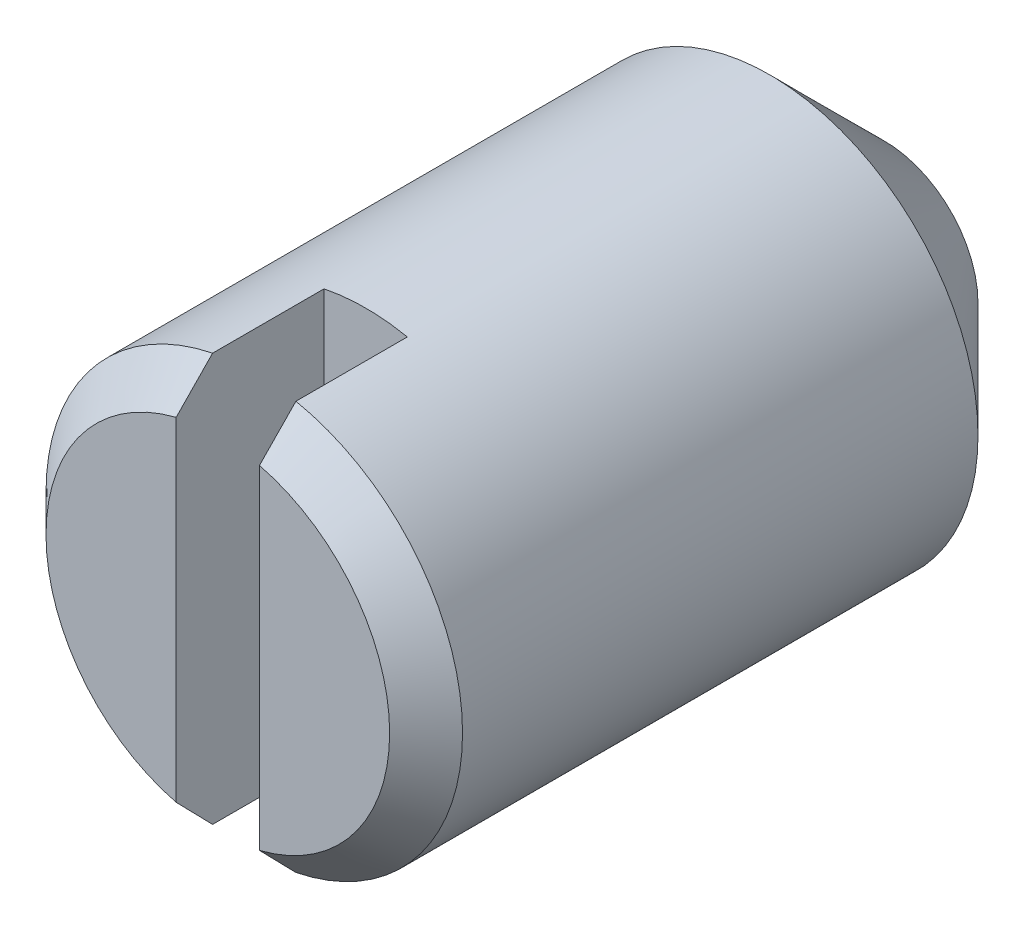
ISO-10303-21;
HEADER;
FILE_DESCRIPTION(('STEP AP214'),'2;1');
FILE_NAME('part.step','',(''),(''),'','','');
FILE_SCHEMA(('AUTOMOTIVE_DESIGN { 1 0 10303 214 1 1 1 1 }'));
ENDSEC;
DATA;
#1=APPLICATION_CONTEXT('core data for automotive mechanical design processes');
#2=APPLICATION_PROTOCOL_DEFINITION('international standard','automotive_design',2000,#1);
#3=PRODUCT_CONTEXT('',#1,'mechanical');
#4=PRODUCT('Part','Part','',(#3));
#5=PRODUCT_RELATED_PRODUCT_CATEGORY('part','',(#4));
#6=PRODUCT_DEFINITION_FORMATION('','',#4);
#7=PRODUCT_DEFINITION_CONTEXT('part definition',#1,'design');
#8=PRODUCT_DEFINITION('design','',#6,#7);
#9=PRODUCT_DEFINITION_SHAPE('','',#8);
#10=(LENGTH_UNIT() NAMED_UNIT(*) SI_UNIT(.MILLI.,.METRE.));
#11=(NAMED_UNIT(*) PLANE_ANGLE_UNIT() SI_UNIT($,.RADIAN.));
#12=(NAMED_UNIT(*) SI_UNIT($,.STERADIAN.) SOLID_ANGLE_UNIT());
#13=UNCERTAINTY_MEASURE_WITH_UNIT(LENGTH_MEASURE(1.E-05),#10,'distance_accuracy_value','');
#14=(GEOMETRIC_REPRESENTATION_CONTEXT(3) GLOBAL_UNCERTAINTY_ASSIGNED_CONTEXT((#13)) GLOBAL_UNIT_ASSIGNED_CONTEXT((#10,
#11,#12)) REPRESENTATION_CONTEXT('',''));
#15=CARTESIAN_POINT('',(0.,0.,0.));
#16=DIRECTION('',(0.,0.,1.));
#17=DIRECTION('',(1.,0.,0.));
#18=AXIS2_PLACEMENT_3D('',#15,#16,#17);
#19=CARTESIAN_POINT('',(-0.400000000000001,0.,-1.07));
#20=DIRECTION('',(0.,0.,-1.));
#21=DIRECTION('',(-1.,0.,0.));
#22=AXIS2_PLACEMENT_3D('',#19,#20,#21);
#23=PLANE('',#22);
#24=DIRECTION('',(0.,1.,0.));
#25=VECTOR('',#24,1.);
#26=CARTESIAN_POINT('',(-0.4,0.,-1.07));
#27=LINE('',#26,#25);
#28=CARTESIAN_POINT('',(-0.4,1.95959179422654,-1.07));
#29=VERTEX_POINT('',#28);
#30=CARTESIAN_POINT('',(-0.4,-1.95959179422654,-1.07));
#31=VERTEX_POINT('',#30);
#32=EDGE_CURVE('E82',#29,#31,#27,.F.);
#33=ORIENTED_EDGE('',*,*,#32,.T.);
#34=CARTESIAN_POINT('',(0.,0.,-1.07));
#35=DIRECTION('',(0.,0.,1.));
#36=DIRECTION('',(1.,0.,0.));
#37=AXIS2_PLACEMENT_3D('',#34,#35,#36);
#38=CIRCLE('',#37,2.);
#39=CARTESIAN_POINT('',(0.400000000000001,-1.95959179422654,-1.07));
#40=VERTEX_POINT('',#39);
#41=EDGE_CURVE('E18',#40,#31,#38,.F.);
#42=ORIENTED_EDGE('',*,*,#41,.F.);
#43=DIRECTION('',(0.,1.,0.));
#44=VECTOR('',#43,1.);
#45=CARTESIAN_POINT('',(0.400000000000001,0.,-1.07));
#46=LINE('',#45,#44);
#47=CARTESIAN_POINT('',(0.400000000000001,1.95959179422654,-1.07));
#48=VERTEX_POINT('',#47);
#49=EDGE_CURVE('E75',#40,#48,#46,.T.);
#50=ORIENTED_EDGE('',*,*,#49,.T.);
#51=CARTESIAN_POINT('',(0.,0.,-1.07));
#52=DIRECTION('',(0.,0.,1.));
#53=DIRECTION('',(1.,0.,0.));
#54=AXIS2_PLACEMENT_3D('',#51,#52,#53);
#55=CIRCLE('',#54,2.);
#56=EDGE_CURVE('E84',#29,#48,#55,.F.);
#57=ORIENTED_EDGE('',*,*,#56,.F.);
#58=EDGE_LOOP('',(#33,#42,#50,#57));
#59=FACE_BOUND('',#58,.T.);
#60=ADVANCED_FACE('F15',(#59),#23,.F.);
#61=CARTESIAN_POINT('',(0.400000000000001,0.,-1.07));
#62=DIRECTION('',(1.,0.,0.));
#63=DIRECTION('',(0.,0.,-1.));
#64=AXIS2_PLACEMENT_3D('',#61,#62,#63);
#65=PLANE('',#64);
#66=ORIENTED_EDGE('',*,*,#49,.F.);
#67=DIRECTION('',(0.,0.,-1.));
#68=VECTOR('',#67,1.);
#69=CARTESIAN_POINT('',(0.400000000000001,-1.95959179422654,-1.07));
#70=LINE('',#69,#68);
#71=CARTESIAN_POINT('',(0.400000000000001,-1.95959179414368,-8.45691484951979E-11));
#72=VERTEX_POINT('',#71);
#73=EDGE_CURVE('E65',#72,#40,#70,.T.);
#74=ORIENTED_EDGE('',*,*,#73,.F.);
#75=CARTESIAN_POINT('',(0.399999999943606,-1.60078105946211,0.350000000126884));
#76=CARTESIAN_POINT('',(0.399999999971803,-1.66072539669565,0.291812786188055));
#77=CARTESIAN_POINT('',(0.399999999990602,-1.72059846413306,0.233552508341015));
#78=CARTESIAN_POINT('',(0.4000000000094,-1.8402020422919,0.116885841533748));
#79=CARTESIAN_POINT('',(0.4000000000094,-1.89993255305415,0.0584794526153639));
#80=CARTESIAN_POINT('',(0.400000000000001,-1.95959179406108,-1.69389283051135E-10));
#81=B_SPLINE_CURVE_WITH_KNOTS('',3,(#75,#76,#77,#78,#79,#80),.UNSPECIFIED.,.F.,.F.,(4,2,4),(0.,
0.250622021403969,0.501243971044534),.UNSPECIFIED.);
#82=CARTESIAN_POINT('',(0.400000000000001,-1.60078105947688,0.350000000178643));
#83=VERTEX_POINT('',#82);
#84=EDGE_CURVE('E76',#83,#72,#81,.T.);
#85=ORIENTED_EDGE('',*,*,#84,.F.);
#86=DIRECTION('',(0.,1.,0.));
#87=VECTOR('',#86,1.);
#88=CARTESIAN_POINT('',(0.4,0.,0.35));
#89=LINE('',#88,#87);
#90=CARTESIAN_POINT('',(0.400000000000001,1.60078105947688,0.350000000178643));
#91=VERTEX_POINT('',#90);
#92=EDGE_CURVE('E176',#91,#83,#89,.F.);
#93=ORIENTED_EDGE('',*,*,#92,.F.);
#94=CARTESIAN_POINT('',(0.40000000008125,1.95959179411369,-1.22284835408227E-10));
#95=CARTESIAN_POINT('',(0.400000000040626,1.89993255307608,0.0584794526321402));
#96=CARTESIAN_POINT('',(0.400000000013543,1.84020204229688,0.116885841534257));
#97=CARTESIAN_POINT('',(0.39999999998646,1.72059846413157,0.233552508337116));
#98=CARTESIAN_POINT('',(0.39999999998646,1.66072539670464,0.291812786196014));
#99=CARTESIAN_POINT('',(0.400000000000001,1.60078105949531,0.350000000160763));
#100=B_SPLINE_CURVE_WITH_KNOTS('',3,(#94,#95,#96,#97,#98,#99),.UNSPECIFIED.,.F.,.F.,(4,2,4),(0.,
0.250621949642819,0.501243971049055),.UNSPECIFIED.);
#101=CARTESIAN_POINT('',(0.400000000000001,1.95959179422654,-1.65755184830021E-10));
#102=VERTEX_POINT('',#101);
#103=EDGE_CURVE('E138',#102,#91,#100,.T.);
#104=ORIENTED_EDGE('',*,*,#103,.F.);
#105=DIRECTION('',(0.,0.,-1.));
#106=VECTOR('',#105,1.);
#107=CARTESIAN_POINT('',(0.400000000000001,1.95959179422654,-1.07));
#108=LINE('',#107,#106);
#109=EDGE_CURVE('E87',#48,#102,#108,.F.);
#110=ORIENTED_EDGE('',*,*,#109,.F.);
#111=EDGE_LOOP('',(#66,#74,#85,#93,#104,#110));
#112=FACE_BOUND('',#111,.T.);
#113=ADVANCED_FACE('F85',(#112),#65,.F.);
#114=CARTESIAN_POINT('',(-0.4,0.,0.350000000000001));
#115=DIRECTION('',(-1.,0.,0.));
#116=DIRECTION('',(0.,0.,1.));
#117=AXIS2_PLACEMENT_3D('',#114,#115,#116);
#118=PLANE('',#117);
#119=CARTESIAN_POINT('',(-0.399999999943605,1.60078105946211,0.350000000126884));
#120=CARTESIAN_POINT('',(-0.399999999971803,1.66072539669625,0.291812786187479));
#121=CARTESIAN_POINT('',(-0.399999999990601,1.72059846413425,0.233552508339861));
#122=CARTESIAN_POINT('',(-0.400000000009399,1.84020204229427,0.116885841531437));
#123=CARTESIAN_POINT('',(-0.400000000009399,1.89993255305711,0.0584794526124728));
#124=CARTESIAN_POINT('',(-0.4,1.95959179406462,-1.72861502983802E-10));
#125=B_SPLINE_CURVE_WITH_KNOTS('',3,(#119,#120,#121,#122,#123,#124),.UNSPECIFIED.,.F.,.F.,(4,2,
4),(0.,0.25062202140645,0.501243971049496),.UNSPECIFIED.);
#126=CARTESIAN_POINT('',(-0.4,1.60078105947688,0.350000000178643));
#127=VERTEX_POINT('',#126);
#128=CARTESIAN_POINT('',(-0.4,1.95959179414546,-8.63090647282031E-11));
#129=VERTEX_POINT('',#128);
#130=EDGE_CURVE('E102',#127,#129,#125,.T.);
#131=ORIENTED_EDGE('',*,*,#130,.F.);
#132=DIRECTION('',(0.,1.,0.));
#133=VECTOR('',#132,1.);
#134=CARTESIAN_POINT('',(-0.4,0.,0.35));
#135=LINE('',#134,#133);
#136=CARTESIAN_POINT('',(-0.4,-1.60078105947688,0.350000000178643));
#137=VERTEX_POINT('',#136);
#138=EDGE_CURVE('E101',#137,#127,#135,.T.);
#139=ORIENTED_EDGE('',*,*,#138,.F.);
#140=CARTESIAN_POINT('',(-0.400000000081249,-1.95959179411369,-1.22284662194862E-10));
#141=CARTESIAN_POINT('',(-0.400000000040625,-1.89993255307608,0.0584794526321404));
#142=CARTESIAN_POINT('',(-0.400000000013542,-1.84020204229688,0.116885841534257));
#143=CARTESIAN_POINT('',(-0.399999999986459,-1.72059846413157,0.233552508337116));
#144=CARTESIAN_POINT('',(-0.399999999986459,-1.66072539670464,0.291812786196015));
#145=CARTESIAN_POINT('',(-0.4,-1.60078105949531,0.350000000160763));
#146=B_SPLINE_CURVE_WITH_KNOTS('',3,(#140,#141,#142,#143,#144,#145),.UNSPECIFIED.,.F.,.F.,(4,2,
4),(0.,0.250621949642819,0.501243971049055),.UNSPECIFIED.);
#147=CARTESIAN_POINT('',(-0.4,-1.95959179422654,-1.65755078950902E-10));
#148=VERTEX_POINT('',#147);
#149=EDGE_CURVE('E33',#148,#137,#146,.T.);
#150=ORIENTED_EDGE('',*,*,#149,.F.);
#151=DIRECTION('',(0.,0.,1.));
#152=VECTOR('',#151,1.);
#153=CARTESIAN_POINT('',(-0.4,-1.95959179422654,0.350000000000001));
#154=LINE('',#153,#152);
#155=EDGE_CURVE('E180',#31,#148,#154,.T.);
#156=ORIENTED_EDGE('',*,*,#155,.F.);
#157=ORIENTED_EDGE('',*,*,#32,.F.);
#158=DIRECTION('',(0.,0.,1.));
#159=VECTOR('',#158,1.);
#160=CARTESIAN_POINT('',(-0.4,1.95959179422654,0.350000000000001));
#161=LINE('',#160,#159);
#162=EDGE_CURVE('E110',#129,#29,#161,.F.);
#163=ORIENTED_EDGE('',*,*,#162,.F.);
#164=EDGE_LOOP('',(#131,#139,#150,#156,#157,#163));
#165=FACE_BOUND('',#164,.T.);
#166=ADVANCED_FACE('F115',(#165),#118,.F.);
#167=CARTESIAN_POINT('',(0.825000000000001,0.,0.35));
#168=DIRECTION('',(0.,0.,1.));
#169=DIRECTION('',(1.,0.,0.));
#170=AXIS2_PLACEMENT_3D('',#167,#168,#169);
#171=PLANE('',#170);
#172=ORIENTED_EDGE('',*,*,#92,.T.);
#173=CARTESIAN_POINT('',(0.,0.,0.35000000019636));
#174=DIRECTION('',(0.,0.,-1.));
#175=DIRECTION('',(-1.,0.,0.));
#176=AXIS2_PLACEMENT_3D('',#173,#174,#175);
#177=CIRCLE('',#176,1.65000000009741);
#178=EDGE_CURVE('E98',#91,#83,#177,.T.);
#179=ORIENTED_EDGE('',*,*,#178,.F.);
#180=EDGE_LOOP('',(#172,#179));
#181=FACE_BOUND('',#180,.T.);
#182=ADVANCED_FACE('F150',(#181),#171,.T.);
#183=CARTESIAN_POINT('',(0.825000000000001,0.,0.35));
#184=DIRECTION('',(0.,0.,1.));
#185=DIRECTION('',(1.,0.,0.));
#186=AXIS2_PLACEMENT_3D('',#183,#184,#185);
#187=PLANE('',#186);
#188=ORIENTED_EDGE('',*,*,#138,.T.);
#189=CARTESIAN_POINT('',(0.,0.,0.35000000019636));
#190=DIRECTION('',(0.,0.,-1.));
#191=DIRECTION('',(-1.,0.,0.));
#192=AXIS2_PLACEMENT_3D('',#189,#190,#191);
#193=CIRCLE('',#192,1.65000000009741);
#194=EDGE_CURVE('E96',#137,#127,#193,.T.);
#195=ORIENTED_EDGE('',*,*,#194,.F.);
#196=EDGE_LOOP('',(#188,#195));
#197=FACE_BOUND('',#196,.T.);
#198=ADVANCED_FACE('F165',(#197),#187,.T.);
#199=CARTESIAN_POINT('',(0.45,0.,-6.05));
#200=DIRECTION('',(0.,0.,-1.));
#201=DIRECTION('',(-1.,0.,0.));
#202=AXIS2_PLACEMENT_3D('',#199,#200,#201);
#203=PLANE('',#202);
#204=CARTESIAN_POINT('',(0.,0.,-6.05000000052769));
#205=DIRECTION('',(0.,0.,1.));
#206=DIRECTION('',(1.,0.,0.));
#207=AXIS2_PLACEMENT_3D('',#204,#205,#206);
#208=CIRCLE('',#207,0.900000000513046);
#209=CARTESIAN_POINT('',(0.900000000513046,0.,-6.05000000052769));
#210=VERTEX_POINT('',#209);
#211=EDGE_CURVE('E93',#210,#210,#208,.T.);
#212=ORIENTED_EDGE('',*,*,#211,.F.);
#213=EDGE_LOOP('',(#212));
#214=FACE_BOUND('',#213,.T.);
#215=ADVANCED_FACE('F130',(#214),#203,.T.);
#216=CARTESIAN_POINT('',(0.,0.,-5.6843418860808E-11));
#217=DIRECTION('',(0.,0.,-1.));
#218=DIRECTION('',(-1.,0.,0.));
#219=AXIS2_PLACEMENT_3D('',#216,#217,#218);
#220=CONICAL_SURFACE('',#219,1.99999999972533,0.785398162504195);
#221=ORIENTED_EDGE('',*,*,#84,.T.);
#222=CARTESIAN_POINT('',(0.,0.,0.));
#223=DIRECTION('',(0.,0.,1.));
#224=DIRECTION('',(1.,0.,0.));
#225=AXIS2_PLACEMENT_3D('',#222,#223,#224);
#226=CIRCLE('',#225,2.);
#227=EDGE_CURVE('E72',#102,#72,#226,.F.);
#228=ORIENTED_EDGE('',*,*,#227,.F.);
#229=ORIENTED_EDGE('',*,*,#103,.T.);
#230=ORIENTED_EDGE('',*,*,#178,.T.);
#231=EDGE_LOOP('',(#221,#228,#229,#230));
#232=FACE_BOUND('',#231,.T.);
#233=ADVANCED_FACE('F124',(#232),#220,.T.);
#234=CARTESIAN_POINT('',(0.,0.,-5.6843418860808E-11));
#235=DIRECTION('',(0.,0.,-1.));
#236=DIRECTION('',(-1.,0.,0.));
#237=AXIS2_PLACEMENT_3D('',#234,#235,#236);
#238=CONICAL_SURFACE('',#237,1.99999999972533,0.785398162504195);
#239=ORIENTED_EDGE('',*,*,#149,.T.);
#240=ORIENTED_EDGE('',*,*,#194,.T.);
#241=ORIENTED_EDGE('',*,*,#130,.T.);
#242=CARTESIAN_POINT('',(0.,0.,0.));
#243=DIRECTION('',(0.,0.,1.));
#244=DIRECTION('',(1.,0.,0.));
#245=AXIS2_PLACEMENT_3D('',#242,#243,#244);
#246=CIRCLE('',#245,2.);
#247=EDGE_CURVE('E24',#148,#129,#246,.F.);
#248=ORIENTED_EDGE('',*,*,#247,.F.);
#249=EDGE_LOOP('',(#239,#240,#241,#248));
#250=FACE_BOUND('',#249,.T.);
#251=ADVANCED_FACE('F118',(#250),#238,.T.);
#252=CARTESIAN_POINT('',(0.,0.,-4.94999999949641));
#253=DIRECTION('',(0.,0.,1.));
#254=DIRECTION('',(1.,0.,0.));
#255=AXIS2_PLACEMENT_3D('',#252,#253,#254);
#256=CONICAL_SURFACE('',#255,1.9999999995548,0.785398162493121);
#257=ORIENTED_EDGE('',*,*,#211,.T.);
#258=EDGE_LOOP('',(#257));
#259=FACE_BOUND('',#258,.T.);
#260=CARTESIAN_POINT('',(0.,0.,-4.95));
#261=DIRECTION('',(0.,0.,1.));
#262=DIRECTION('',(1.,0.,0.));
#263=AXIS2_PLACEMENT_3D('',#260,#261,#262);
#264=CIRCLE('',#263,2.);
#265=CARTESIAN_POINT('',(2.,0.,-4.95));
#266=VERTEX_POINT('',#265);
#267=EDGE_CURVE('E10',#266,#266,#264,.T.);
#268=ORIENTED_EDGE('',*,*,#267,.F.);
#269=EDGE_LOOP('',(#268));
#270=FACE_BOUND('',#269,.T.);
#271=ADVANCED_FACE('F123',(#259,#270),#256,.T.);
#272=CARTESIAN_POINT('',(0.,0.,-2.475));
#273=DIRECTION('',(0.,0.,1.));
#274=DIRECTION('',(1.,0.,0.));
#275=AXIS2_PLACEMENT_3D('',#272,#273,#274);
#276=CYLINDRICAL_SURFACE('',#275,2.);
#277=ORIENTED_EDGE('',*,*,#267,.T.);
#278=EDGE_LOOP('',(#277));
#279=FACE_BOUND('',#278,.T.);
#280=ORIENTED_EDGE('',*,*,#162,.T.);
#281=ORIENTED_EDGE('',*,*,#56,.T.);
#282=ORIENTED_EDGE('',*,*,#109,.T.);
#283=ORIENTED_EDGE('',*,*,#227,.T.);
#284=ORIENTED_EDGE('',*,*,#73,.T.);
#285=ORIENTED_EDGE('',*,*,#41,.T.);
#286=ORIENTED_EDGE('',*,*,#155,.T.);
#287=ORIENTED_EDGE('',*,*,#247,.T.);
#288=EDGE_LOOP('',(#280,#281,#282,#283,#284,#285,#286,#287));
#289=FACE_BOUND('',#288,.T.);
#290=ADVANCED_FACE('F68',(#279,#289),#276,.T.);
#291=CLOSED_SHELL('',(#60,#113,#166,#182,#198,#215,#233,#251,#271,#290));
#292=MANIFOLD_SOLID_BREP('B1',#291);
#293=ADVANCED_BREP_SHAPE_REPRESENTATION('',(#18,#292),#14);
#294=SHAPE_DEFINITION_REPRESENTATION(#9,#293);
ENDSEC;
END-ISO-10303-21;
